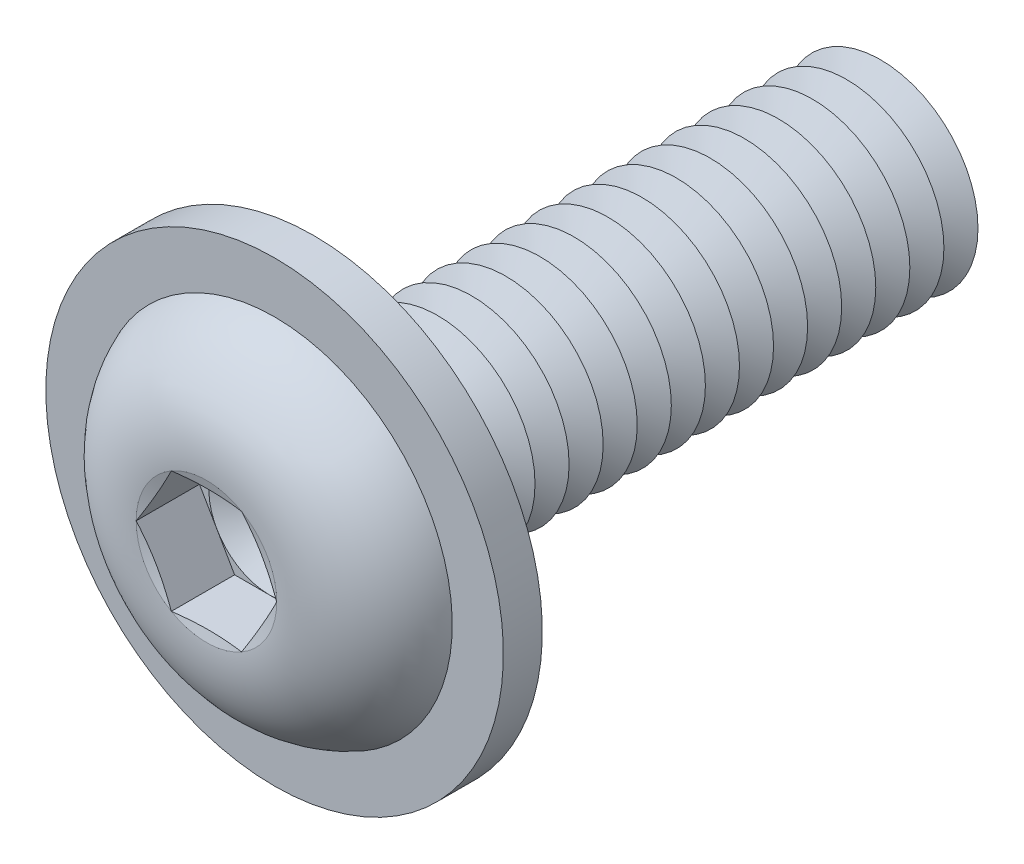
from build123d import *

# Parameters (mm, degrees)
FILLET1_R           = 0.35
LPATTERN1_COUNT     = 17
LPATTERN1_PITCH     = 0.7
CUT_EXTRUDE1_DEPTH  = 1.3
SKETCH5_R           = 4.7
SKETCH5_R_2         = 2.35
BOSS_EXTRUDE1_DEPTH = 0.8


with BuildPart() as part:
    # Sketch1 → Revolve1 (revolve)
    with BuildSketch(Plane(origin=(0, 0, 0), x_dir=(0, 0, -1), z_dir=(1, 0, 0)), mode=Mode.PRIVATE) as revolve1_sk:
        with BuildLine():
            Line((0, 2), (0, 3.8))
            ThreePointArc((0, 3.8), (-1.611961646, 3.099623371), (-2.2, 1.443375))
            Line((-2.2, 1.443375), (-2.006624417, 0.7216875))
            Line((-2.006624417, 0.7216875), (-2.2, 0.7216875))
            Line((-2.2, 0.7216875), (-2.2, 0))
            Line((-2.2, 0), (12, 0))
            Line((12, 0), (12, 2))
            Line((12, 2), (0, 2))
        make_face()
    revolve(revolve1_sk.sketch.rotate(Axis((0, 0, -12), (0, 0, 1)), 90), axis=Axis((0, 0, -12), (0, 0, 1)))

    # Fillet1
    fillet1_edges = [part.edges().sort_by_distance(p)[0] for p in [
        (2, 0, 0),
    ]]
    fillet(fillet1_edges, radius=FILLET1_R)

    # Sketch2 → Cut-Revolve1 (revolve, cut)
    with BuildSketch(Plane(origin=(0, 0, 0), x_dir=(0, 0, -1), z_dir=(1, 0, 0)), mode=Mode.PRIVATE) as cut_revolve1_sk:
        Polygon((11.65, 2), (12.35, 2), (12, 1.393782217), align=None)
    cut_revolve1 = revolve(cut_revolve1_sk.sketch.rotate(Axis((0, 0, -12), (0, 0, -1)), 270), axis=Axis((0, 0, -12), (0, 0, -1)), mode=Mode.SUBTRACT)

    # LPattern1: Cut-Revolve1 ×17
    with Locations(*[(0, 0, i * LPATTERN1_PITCH) for i in range(1, LPATTERN1_COUNT)]):
        add(cut_revolve1, mode=Mode.SUBTRACT)

    # Sketch3 → Cut-Extrude1 (cut)
    with BuildSketch(Plane.XY.offset(2.2)):
        Polygon((0.7216875, 1.249999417), (-0.7216875, 1.249999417), (-1.443375, 0), (-0.7216875, -1.249999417), (0.7216875, -1.249999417), (1.443375, 0), align=None)
    extrude(amount=-CUT_EXTRUDE1_DEPTH, mode=Mode.SUBTRACT)

    # Cut-Extrude2 cone 1 section (on through the dimple's axis) → Cut-Extrude2 (revolve, cut)
    with BuildSketch(Plane(origin=(0, 0, 0.9), x_dir=(0, -1, 0), z_dir=(1, 0, 0))):
        Polygon((0, 0), (1.249999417, 0), (0, 0.7216875), align=None)
    revolve(axis=Axis((0, 0, 0.9), (0, 0, -1)), mode=Mode.SUBTRACT)

    # Sketch5 → Boss-Extrude1 (add)
    with BuildSketch(Plane(origin=(0, 0, 0), x_dir=(-1, 0, 0), z_dir=(0, 0, -1))):
        with Locations(Location((0, 0, 0), (0, 0, 90))):
            Circle(SKETCH5_R)
        Circle(SKETCH5_R_2, mode=Mode.SUBTRACT)
    extrude(amount=-BOSS_EXTRUDE1_DEPTH)


solid = part.part
